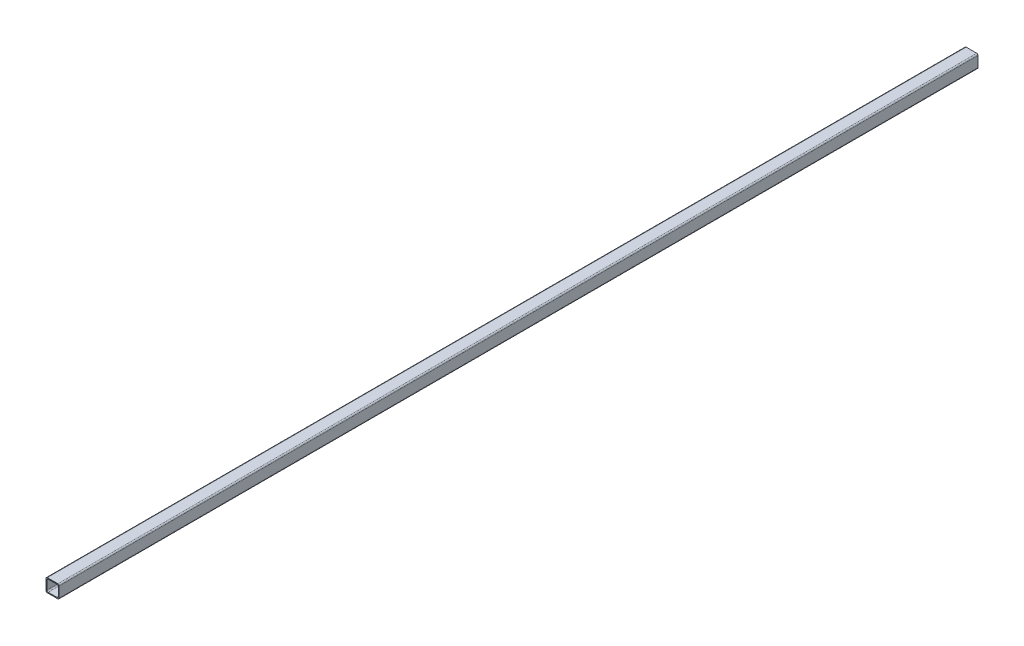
from build123d import *

# Parameters (mm, degrees)
ESQUISSE1_W        = 30
ESQUISSE1_H        = 30
ESQUISSE1_W_2      = 26
ESQUISSE1_H_2      = 26
EXTRU_MINCE1_DEPTH = 2100
CONG_1_R           = 3


with BuildPart() as part:
    # Esquisse1 → Extru.-Mince1 (new body)
    with BuildSketch(Plane.XY):
        with Locations((15, 15)):
            Rectangle(ESQUISSE1_W, ESQUISSE1_H)
        with Locations((15, 15)):
            Rectangle(ESQUISSE1_W_2, ESQUISSE1_H_2, mode=Mode.SUBTRACT)
    extrude(amount=EXTRU_MINCE1_DEPTH)

    # Cong_1
    cong_1_edges = [part.edges().sort_by_distance(p)[0] for p in [
        (2, 28, 1050),
        (2, 2, 1050),
        (28, 2, 1050),
        (28, 28, 1050),
        (0, 30, 1050),
        (30, 30, 1050),
        (30, 0, 1050),
        (0, 0, 1050),
    ]]
    fillet(cong_1_edges, radius=CONG_1_R)


solid = part.part
